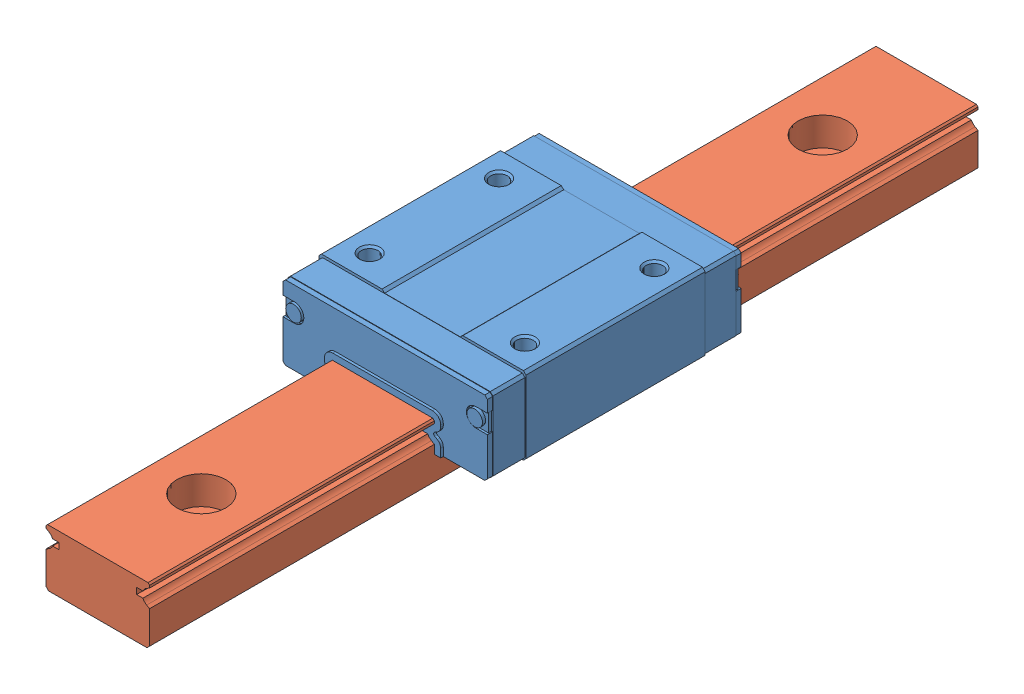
SolidWorks assembly MLN20C.stp.sldasm, configuration 默认 (file format 13000). Lengths in mm.
Overall size (40 20 160).
2 component instances, 2 part files, 0 mates.
Components (placement in the parent):
- MLN20C--1: MLN20C-.SLDPRT [默认] at origin size (40 15 50)
- MLNR20R160 E=20--1: MLNR20R160 E=20-.SLDPRT [默认] at origin size (20 11 160)
